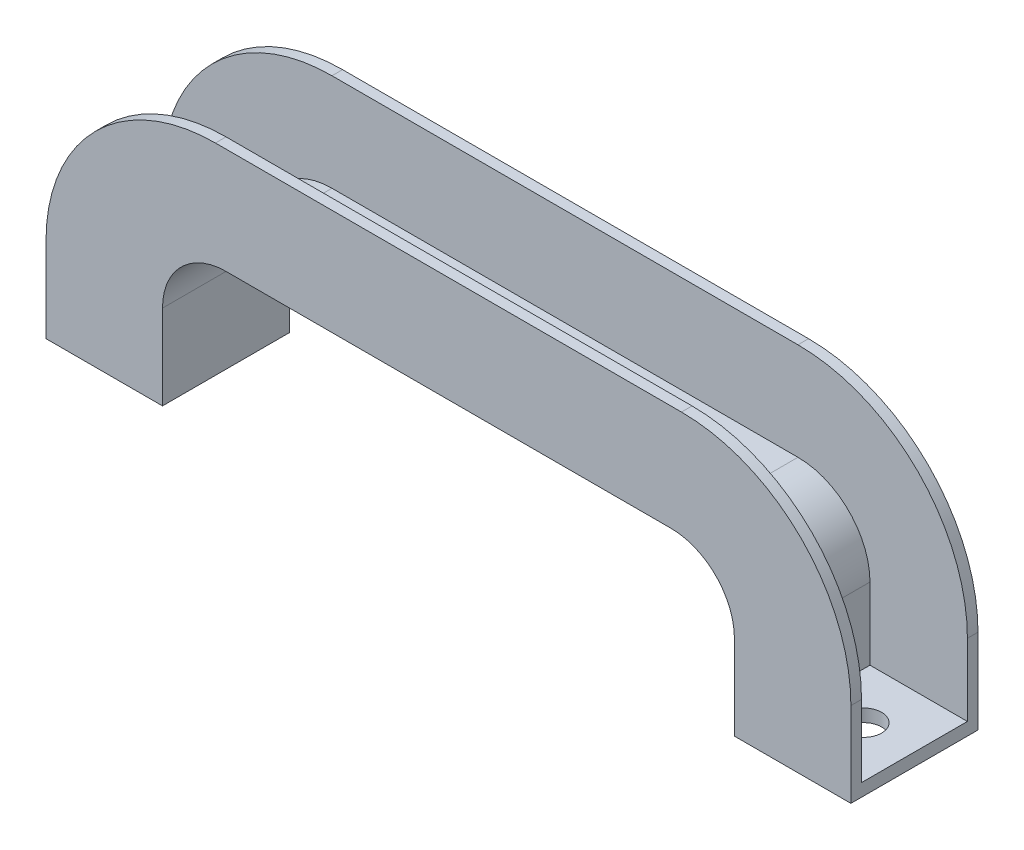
from build123d import *

# Parameters (mm, degrees)
BASE_EXTRUSION_DEPTH    = 15
ENL_V_MAT_EXTRU_1_DEPTH = 12.5
ESQUISSE3_R             = 4.25
ENL_V_MAT_EXTRU_3_DEPTH = 200.812412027


with BuildPart() as part:
    # Esquisse1 → Base-Extrusion (new, symmetric)
    with BuildSketch(Plane.XY):
        with BuildLine():
            Line((0, 0), (0, 20))
            ThreePointArc((0, 20), (11.715728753, 48.284271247), (40, 60))
            Line((40, 60), (150, 60))
            ThreePointArc((150, 60), (178.284271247, 48.284271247), (190, 20))
            Line((190, 20), (190, 0))
            Line((190, 0), (162.5, 0))
            Line((162.5, 0), (162.5, 20))
            ThreePointArc((162.5, 20), (158.106601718, 30.606601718), (147.5, 35))
            Line((147.5, 35), (42.5, 35))
            ThreePointArc((42.5, 35), (31.893398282, 30.606601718), (27.5, 20))
            Line((27.5, 20), (27.5, 0))
            Line((27.5, 0), (0, 0))
        make_face()
    extrude(amount=BASE_EXTRUSION_DEPTH, both=True)

    # Esquisse2 → Enl_v. mat.-Extru.1 (cut, symmetric)
    with BuildSketch(Plane.XY):
        with BuildLine():
            Line((23, 20), (23, 3))
            Line((23, 3), (-29.777456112, 3))
            Line((-29.777456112, 3), (-26.867838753, 105.603161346))
            Line((-26.867838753, 105.603161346), (213.521205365, 95.539241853))
            Line((213.521205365, 95.539241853), (209.647037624, 3))
            Line((209.647037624, 3), (167, 3))
            Line((167, 3), (167, 20))
            ThreePointArc((167, 20), (162.02081528, 32.02081528), (150, 37))
            Line((150, 37), (40, 37))
            ThreePointArc((40, 37), (27.97918472, 32.02081528), (23, 20))
        make_face()
    extrude(amount=ENL_V_MAT_EXTRU_1_DEPTH, both=True, mode=Mode.SUBTRACT)

    # Esquisse3 → Enl_v. mat.-Extru.3 (cut, through all)
    with BuildSketch(Plane.XZ):
        with Locations(Location((12, 0, 0), (0, 0, 270))):
            Circle(ESQUISSE3_R)
        with Locations(Location((178, 0, 0), (0, 0, 270))):
            Circle(ESQUISSE3_R)
    extrude(amount=-ENL_V_MAT_EXTRU_3_DEPTH, mode=Mode.SUBTRACT)


solid = part.part
